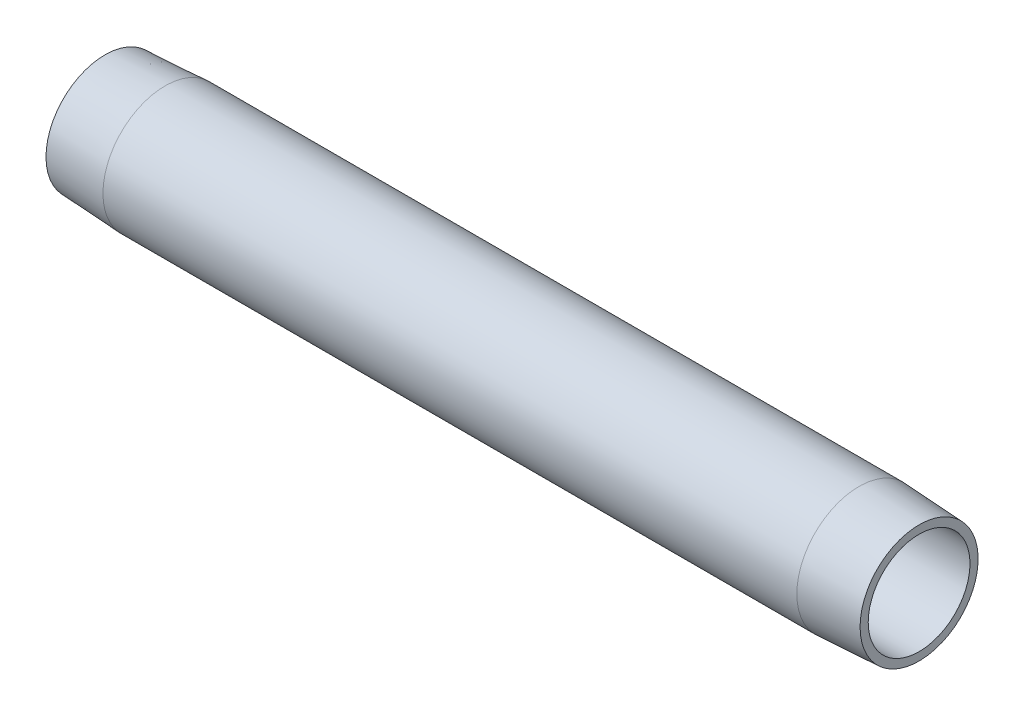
from build123d import *


with BuildPart() as part:
    # Sketch1 → Revolve1 (revolve)
    with BuildSketch(Plane.XY, mode=Mode.PRIVATE) as revolve1_sk:
        Polygon((139.7, 8.73125), (0, 8.73125), (0, 10.127550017), (10.3124, 10.668), (129.3876, 10.668), (139.7, 10.127550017), align=None)
    revolve(revolve1_sk.sketch.rotate(Axis((0, 0, 0), (1, 0, 0)), 90), axis=Axis((0, 0, 0), (1, 0, 0)))


solid = part.part
